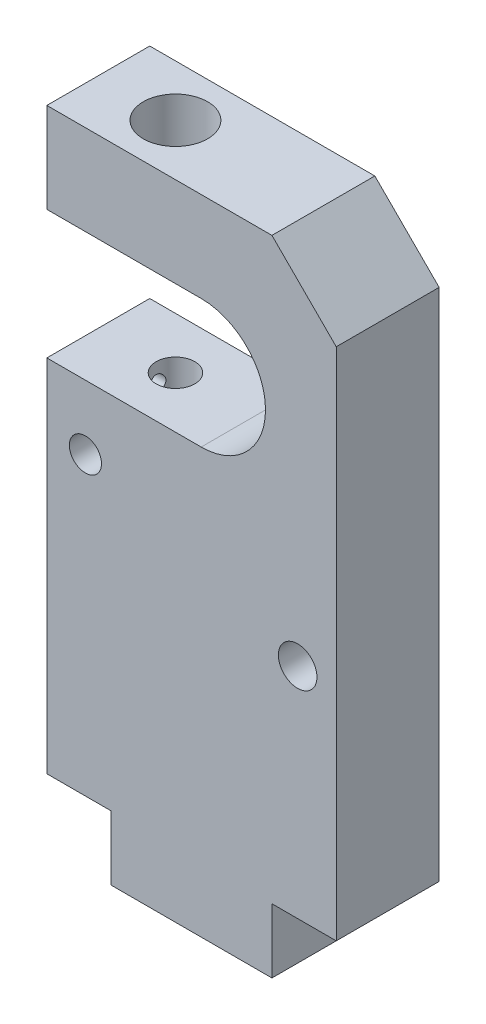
from build123d import *

# Parameters (mm, degrees)
ESQUISSE1_R                         = 3
ESQUISSE1_R_2                       = 2.5
EXTRUSION1_DEPTH                    = 8
TROU_TARAUD_M61_D                   = 5
TROU_TARAUD_M61_DEPTH               = 20
TROU_TARAUD_M61_TIP                 = 1.502151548
TROU_TARAUD_M31_D                   = 2.5
TROU_TARAUD_M31_DEPTH               = 13.5
TROU_TARAUD_M31_TIP                 = 0.751075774
DIAM_TRE_DU_PER_AGE_10_0_10_1_D     = 10
DIAM_TRE_DU_PER_AGE_10_0_10_1_DEPTH = 14
PER_AGE1_D                          = 4
PER_AGE1_DEPTH                      = 30
PER_AGE1_CBORE_D                    = 6
PER_AGE1_CBORE_DEPTH                = 6
PER_AGE1_TIP                        = 1.201721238
EXTRUSION2_REACH                    = 107.28
EXTRUSION2_END_RADIUS               = 2
ESQUISSE11_R                        = 2


with BuildPart() as part:
    # Esquisse1 → Extrusion1 (new, symmetric)
    with BuildSketch(Plane.XY):
        with BuildLine():
            Line((12.5, 0), (12.5, 10))
            Line((12.5, 10), (22.5, 10))
            Line((22.5, 10), (22.5, 90))
            Line((22.5, 90), (12.5, 100))
            Line((12.5, 100), (-22.5, 100))
            Line((-22.5, 100), (-22.5, 86))
            Line((-22.5, 86), (1.5, 86))
            ThreePointArc((1.5, 86), (11.5, 76), (1.5, 66))
            Line((1.5, 66), (-22.5, 66))
            Line((-22.5, 66), (-22.5, 10))
            Line((-22.5, 10), (-12.5, 10))
            Line((-12.5, 10), (-12.5, 0))
            Line((-12.5, 0), (12.5, 0))
        make_face()
        with Locations((16.5, 44)):
            Circle(ESQUISSE1_R, mode=Mode.SUBTRACT)
        with Locations((-16.5, 56)):
            Circle(ESQUISSE1_R_2, mode=Mode.SUBTRACT)
    extrude(amount=EXTRUSION1_DEPTH, both=True)

    # Trou taraud_ M61
    with Locations(Plane.XZ):
        with Locations((0, 0)):
            Hole(TROU_TARAUD_M61_D / 2, depth=TROU_TARAUD_M61_DEPTH)
            with Locations((0, 0, -(TROU_TARAUD_M61_DEPTH + TROU_TARAUD_M61_TIP / 2))):  # 118° drill point
                Cone(0, TROU_TARAUD_M61_D / 2, TROU_TARAUD_M61_TIP, mode=Mode.SUBTRACT)

    # Trou taraud_ M31
    with Locations(Plane.ZY.offset(22.5)):
        with Locations((0, 63)):
            Hole(TROU_TARAUD_M31_D / 2, depth=TROU_TARAUD_M31_DEPTH)
            with Locations((0, 0, -(TROU_TARAUD_M31_DEPTH + TROU_TARAUD_M31_TIP / 2))):  # 118° drill point
                Cone(0, TROU_TARAUD_M31_D / 2, TROU_TARAUD_M31_TIP, mode=Mode.SUBTRACT)

    # Diam_tre du per_age _10.0 _10_1
    with Locations(Plane(origin=(0, 100, 0), x_dir=(-1, 0, 0), z_dir=(0, 1, 0))):
        with Locations((10.5, 0)):
            Hole(DIAM_TRE_DU_PER_AGE_10_0_10_1_D / 2, depth=DIAM_TRE_DU_PER_AGE_10_0_10_1_DEPTH)

    # Per_age1
    with Locations(Plane(origin=(0, 66, 0), x_dir=(-1, 0, 0), z_dir=(0, 1, 0))):
        with Locations((10.5, 0)):
            CounterBoreHole(PER_AGE1_D / 2, PER_AGE1_CBORE_D / 2, PER_AGE1_CBORE_DEPTH, depth=PER_AGE1_DEPTH)
            with Locations((0, 0, -(PER_AGE1_DEPTH + PER_AGE1_TIP / 2))):  # 118° drill point
                Cone(0, PER_AGE1_D / 2, PER_AGE1_TIP, mode=Mode.SUBTRACT)

    # Extrusion2: up to this cylinder (the profile starts outside it)
    extrusion2_end = Plane(origin=(-10.5, 13.5, 0), z_dir=(0, 1, 0)) * Cylinder(EXTRUSION2_END_RADIUS, 219.56, mode=Mode.PRIVATE)
    # Esquisse11 → Extrusion2 (cut, up to the surface)
    with BuildSketch(Plane(origin=(-1.294872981, -2.242785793, 0), x_dir=(0.8660254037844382, -0.500000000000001, 0), z_dir=(-0.500000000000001, -0.8660254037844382, 0)), mode=Mode.PRIVATE) as extrusion2_sk1:
        with Locations((-31.485571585, 0)):
            Circle(ESQUISSE11_R)
    extrusion2_tool1 = extrude(extrusion2_sk1.sketch, amount=-EXTRUSION2_REACH, mode=Mode.PRIVATE) - extrusion2_end
    add(extrusion2_tool1.solids().sort_by_distance((-28.562178, 13.5, 0))[0], mode=Mode.SUBTRACT)


solid = part.part
